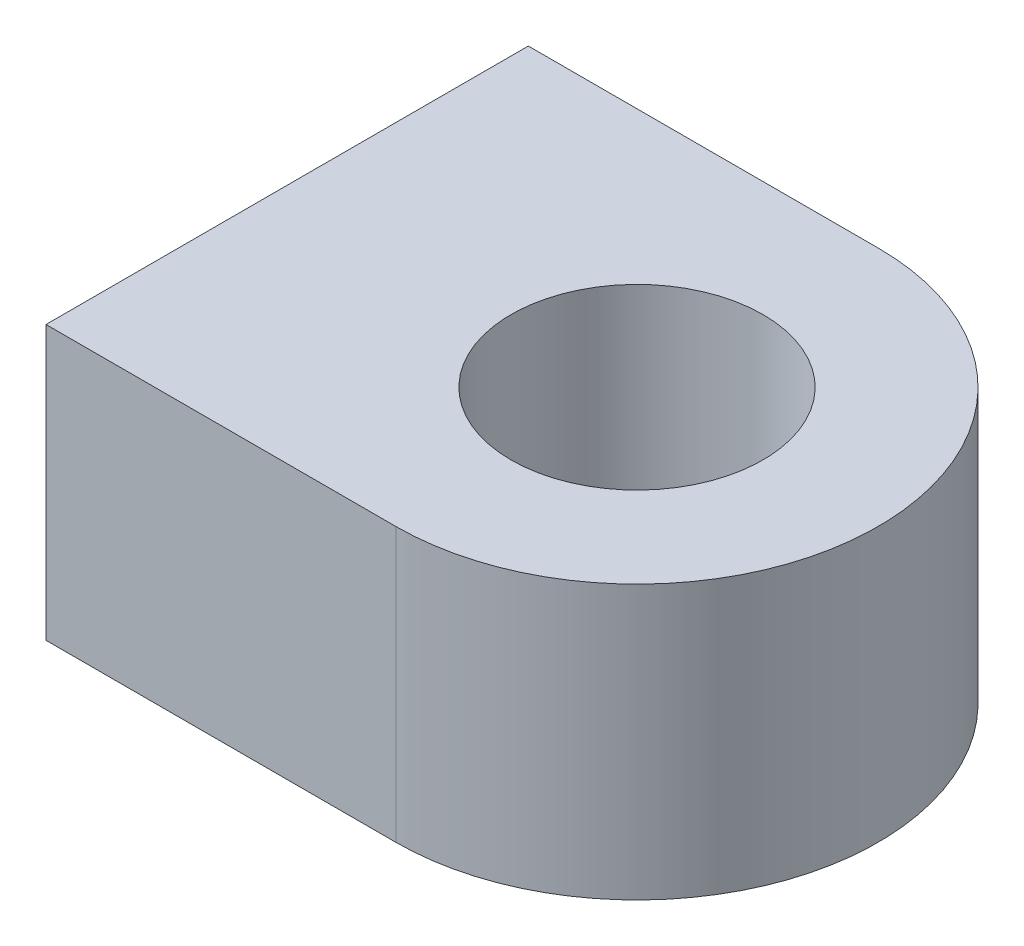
ISO-10303-21;
HEADER;
FILE_DESCRIPTION(('STEP AP214'),'2;1');
FILE_NAME('part.step','',(''),(''),'','','');
FILE_SCHEMA(('AUTOMOTIVE_DESIGN { 1 0 10303 214 1 1 1 1 }'));
ENDSEC;
DATA;
#1=APPLICATION_CONTEXT('core data for automotive mechanical design processes');
#2=APPLICATION_PROTOCOL_DEFINITION('international standard','automotive_design',2000,#1);
#3=PRODUCT_CONTEXT('',#1,'mechanical');
#4=PRODUCT('Part','Part','',(#3));
#5=PRODUCT_RELATED_PRODUCT_CATEGORY('part','',(#4));
#6=PRODUCT_DEFINITION_FORMATION('','',#4);
#7=PRODUCT_DEFINITION_CONTEXT('part definition',#1,'design');
#8=PRODUCT_DEFINITION('design','',#6,#7);
#9=PRODUCT_DEFINITION_SHAPE('','',#8);
#10=(LENGTH_UNIT() NAMED_UNIT(*) SI_UNIT(.MILLI.,.METRE.));
#11=(NAMED_UNIT(*) PLANE_ANGLE_UNIT() SI_UNIT($,.RADIAN.));
#12=(NAMED_UNIT(*) SI_UNIT($,.STERADIAN.) SOLID_ANGLE_UNIT());
#13=UNCERTAINTY_MEASURE_WITH_UNIT(LENGTH_MEASURE(1.E-05),#10,'distance_accuracy_value','');
#14=(GEOMETRIC_REPRESENTATION_CONTEXT(3) GLOBAL_UNCERTAINTY_ASSIGNED_CONTEXT((#13)) GLOBAL_UNIT_ASSIGNED_CONTEXT((#10,
#11,#12)) REPRESENTATION_CONTEXT('',''));
#15=CARTESIAN_POINT('',(0.,0.,0.));
#16=DIRECTION('',(0.,0.,1.));
#17=DIRECTION('',(1.,0.,0.));
#18=AXIS2_PLACEMENT_3D('',#15,#16,#17);
#19=CARTESIAN_POINT('',(0.,5.08,0.));
#20=DIRECTION('',(0.,-1.,0.));
#21=DIRECTION('',(0.,0.,-1.));
#22=AXIS2_PLACEMENT_3D('',#19,#20,#21);
#23=CYLINDRICAL_SURFACE('',#22,2.2225);
#24=CARTESIAN_POINT('',(0.,0.762,0.));
#25=DIRECTION('',(0.,-1.,0.));
#26=DIRECTION('',(0.,0.,-1.));
#27=AXIS2_PLACEMENT_3D('',#24,#25,#26);
#28=CIRCLE('',#27,2.2225);
#29=CARTESIAN_POINT('',(0.,0.762,-2.2225));
#30=VERTEX_POINT('',#29);
#31=EDGE_CURVE('E11',#30,#30,#28,.T.);
#32=ORIENTED_EDGE('',*,*,#31,.T.);
#33=EDGE_LOOP('',(#32));
#34=FACE_BOUND('',#33,.T.);
#35=CARTESIAN_POINT('',(0.,4.826,0.));
#36=DIRECTION('',(0.,1.,0.));
#37=DIRECTION('',(0.,0.,1.));
#38=AXIS2_PLACEMENT_3D('',#35,#36,#37);
#39=CIRCLE('',#38,2.2225);
#40=CARTESIAN_POINT('',(0.,4.826,2.2225));
#41=VERTEX_POINT('',#40);
#42=EDGE_CURVE('E108',#41,#41,#39,.T.);
#43=ORIENTED_EDGE('',*,*,#42,.T.);
#44=EDGE_LOOP('',(#43));
#45=FACE_BOUND('',#44,.T.);
#46=ADVANCED_FACE('F43',(#34,#45),#23,.F.);
#47=CARTESIAN_POINT('',(0.,0.762,0.));
#48=DIRECTION('',(0.,-1.,0.));
#49=DIRECTION('',(0.,0.,-1.));
#50=AXIS2_PLACEMENT_3D('',#47,#48,#49);
#51=PLANE('',#50);
#52=ORIENTED_EDGE('',*,*,#31,.F.);
#53=EDGE_LOOP('',(#52));
#54=FACE_BOUND('',#53,.T.);
#55=ADVANCED_FACE('F134',(#54),#51,.F.);
#56=CARTESIAN_POINT('',(0.,4.826,0.));
#57=DIRECTION('',(0.,1.,0.));
#58=DIRECTION('',(0.,0.,1.));
#59=AXIS2_PLACEMENT_3D('',#56,#57,#58);
#60=PLANE('',#59);
#61=ORIENTED_EDGE('',*,*,#42,.F.);
#62=EDGE_LOOP('',(#61));
#63=FACE_BOUND('',#62,.T.);
#64=DIRECTION('',(-1.,0.,0.));
#65=VECTOR('',#64,1.);
#66=CARTESIAN_POINT('',(0.,4.826,-4.25450000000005));
#67=LINE('',#66,#65);
#68=CARTESIAN_POINT('',(0.,4.826,-4.25450000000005));
#69=VERTEX_POINT('',#68);
#70=CARTESIAN_POINT('',(-6.17220000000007,4.826,-4.25450000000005));
#71=VERTEX_POINT('',#70);
#72=EDGE_CURVE('E94',#69,#71,#67,.T.);
#73=ORIENTED_EDGE('',*,*,#72,.T.);
#74=DIRECTION('',(0.,0.,1.));
#75=VECTOR('',#74,1.);
#76=CARTESIAN_POINT('',(-6.17220000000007,4.826,-4.25450000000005));
#77=LINE('',#76,#75);
#78=CARTESIAN_POINT('',(-6.17220000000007,4.826,4.25450000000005));
#79=VERTEX_POINT('',#78);
#80=EDGE_CURVE('E116',#71,#79,#77,.T.);
#81=ORIENTED_EDGE('',*,*,#80,.T.);
#82=DIRECTION('',(1.,0.,0.));
#83=VECTOR('',#82,1.);
#84=CARTESIAN_POINT('',(-6.17220000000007,4.826,4.25450000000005));
#85=LINE('',#84,#83);
#86=CARTESIAN_POINT('',(0.,4.826,4.25450000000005));
#87=VERTEX_POINT('',#86);
#88=EDGE_CURVE('E57',#79,#87,#85,.T.);
#89=ORIENTED_EDGE('',*,*,#88,.T.);
#90=CARTESIAN_POINT('',(0.,4.826,0.));
#91=DIRECTION('',(0.,1.,0.));
#92=DIRECTION('',(0.,0.,1.));
#93=AXIS2_PLACEMENT_3D('',#90,#91,#92);
#94=CIRCLE('',#93,4.25450000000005);
#95=EDGE_CURVE('E111',#87,#69,#94,.T.);
#96=ORIENTED_EDGE('',*,*,#95,.T.);
#97=EDGE_LOOP('',(#73,#81,#89,#96));
#98=FACE_BOUND('',#97,.T.);
#99=ADVANCED_FACE('F120',(#63,#98),#60,.T.);
#100=CARTESIAN_POINT('',(0.,0.,0.));
#101=DIRECTION('',(0.,1.,0.));
#102=DIRECTION('',(0.,0.,1.));
#103=AXIS2_PLACEMENT_3D('',#100,#101,#102);
#104=PLANE('',#103);
#105=DIRECTION('',(1.,0.,0.));
#106=VECTOR('',#105,1.);
#107=CARTESIAN_POINT('',(0.,0.,4.25450000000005));
#108=LINE('',#107,#106);
#109=CARTESIAN_POINT('',(-6.17220000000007,0.,4.25450000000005));
#110=VERTEX_POINT('',#109);
#111=CARTESIAN_POINT('',(0.,0.,4.25450000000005));
#112=VERTEX_POINT('',#111);
#113=EDGE_CURVE('E106',#110,#112,#108,.T.);
#114=ORIENTED_EDGE('',*,*,#113,.F.);
#115=DIRECTION('',(0.,0.,1.));
#116=VECTOR('',#115,1.);
#117=CARTESIAN_POINT('',(-6.17220000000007,0.,0.));
#118=LINE('',#117,#116);
#119=CARTESIAN_POINT('',(-6.17220000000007,0.,-4.25450000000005));
#120=VERTEX_POINT('',#119);
#121=EDGE_CURVE('E50',#120,#110,#118,.T.);
#122=ORIENTED_EDGE('',*,*,#121,.F.);
#123=DIRECTION('',(-1.,0.,0.));
#124=VECTOR('',#123,1.);
#125=CARTESIAN_POINT('',(0.,0.,-4.25450000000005));
#126=LINE('',#125,#124);
#127=CARTESIAN_POINT('',(0.,0.,-4.25450000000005));
#128=VERTEX_POINT('',#127);
#129=EDGE_CURVE('E78',#128,#120,#126,.T.);
#130=ORIENTED_EDGE('',*,*,#129,.F.);
#131=CARTESIAN_POINT('',(0.,0.,0.));
#132=DIRECTION('',(0.,1.,0.));
#133=DIRECTION('',(-1.,0.,0.));
#134=AXIS2_PLACEMENT_3D('',#131,#132,#133);
#135=CIRCLE('',#134,4.25450000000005);
#136=EDGE_CURVE('E82',#128,#112,#135,.F.);
#137=ORIENTED_EDGE('',*,*,#136,.T.);
#138=EDGE_LOOP('',(#114,#122,#130,#137));
#139=FACE_BOUND('',#138,.T.);
#140=ADVANCED_FACE('F80',(#139),#104,.F.);
#141=CARTESIAN_POINT('',(0.,-13.4580516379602,0.));
#142=DIRECTION('',(0.,1.,0.));
#143=DIRECTION('',(0.,0.,1.));
#144=AXIS2_PLACEMENT_3D('',#141,#142,#143);
#145=CYLINDRICAL_SURFACE('',#144,4.25450000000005);
#146=DIRECTION('',(0.,1.,0.));
#147=VECTOR('',#146,1.);
#148=CARTESIAN_POINT('',(0.,-13.4580516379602,-4.25450000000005));
#149=LINE('',#148,#147);
#150=EDGE_CURVE('E91',#128,#69,#149,.T.);
#151=ORIENTED_EDGE('',*,*,#150,.T.);
#152=ORIENTED_EDGE('',*,*,#95,.F.);
#153=DIRECTION('',(0.,1.,0.));
#154=VECTOR('',#153,1.);
#155=CARTESIAN_POINT('',(0.,-13.4580516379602,4.25450000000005));
#156=LINE('',#155,#154);
#157=EDGE_CURVE('E100',#112,#87,#156,.T.);
#158=ORIENTED_EDGE('',*,*,#157,.F.);
#159=ORIENTED_EDGE('',*,*,#136,.F.);
#160=EDGE_LOOP('',(#151,#152,#158,#159));
#161=FACE_BOUND('',#160,.T.);
#162=ADVANCED_FACE('F98',(#161),#145,.T.);
#163=CARTESIAN_POINT('',(0.,-13.4580516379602,-4.25450000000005));
#164=DIRECTION('',(0.,0.,1.));
#165=DIRECTION('',(1.,0.,0.));
#166=AXIS2_PLACEMENT_3D('',#163,#164,#165);
#167=PLANE('',#166);
#168=ORIENTED_EDGE('',*,*,#72,.F.);
#169=ORIENTED_EDGE('',*,*,#150,.F.);
#170=ORIENTED_EDGE('',*,*,#129,.T.);
#171=DIRECTION('',(0.,1.,0.));
#172=VECTOR('',#171,1.);
#173=CARTESIAN_POINT('',(-6.17220000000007,-13.4580516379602,-4.25450000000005));
#174=LINE('',#173,#172);
#175=EDGE_CURVE('E86',#120,#71,#174,.T.);
#176=ORIENTED_EDGE('',*,*,#175,.T.);
#177=EDGE_LOOP('',(#168,#169,#170,#176));
#178=FACE_BOUND('',#177,.T.);
#179=ADVANCED_FACE('F92',(#178),#167,.F.);
#180=CARTESIAN_POINT('',(0.,-13.4580516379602,4.25450000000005));
#181=DIRECTION('',(0.,0.,-1.));
#182=DIRECTION('',(-1.,0.,0.));
#183=AXIS2_PLACEMENT_3D('',#180,#181,#182);
#184=PLANE('',#183);
#185=ORIENTED_EDGE('',*,*,#88,.F.);
#186=DIRECTION('',(0.,1.,0.));
#187=VECTOR('',#186,1.);
#188=CARTESIAN_POINT('',(-6.17220000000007,-13.4580516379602,4.25450000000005));
#189=LINE('',#188,#187);
#190=EDGE_CURVE('E87',#110,#79,#189,.T.);
#191=ORIENTED_EDGE('',*,*,#190,.F.);
#192=ORIENTED_EDGE('',*,*,#113,.T.);
#193=ORIENTED_EDGE('',*,*,#157,.T.);
#194=EDGE_LOOP('',(#185,#191,#192,#193));
#195=FACE_BOUND('',#194,.T.);
#196=ADVANCED_FACE('F124',(#195),#184,.F.);
#197=CARTESIAN_POINT('',(-6.17220000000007,-10.3073312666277,0.));
#198=DIRECTION('',(1.,0.,0.));
#199=DIRECTION('',(0.,0.,-1.));
#200=AXIS2_PLACEMENT_3D('',#197,#198,#199);
#201=PLANE('',#200);
#202=ORIENTED_EDGE('',*,*,#80,.F.);
#203=ORIENTED_EDGE('',*,*,#175,.F.);
#204=ORIENTED_EDGE('',*,*,#121,.T.);
#205=ORIENTED_EDGE('',*,*,#190,.T.);
#206=EDGE_LOOP('',(#202,#203,#204,#205));
#207=FACE_BOUND('',#206,.T.);
#208=ADVANCED_FACE('F123',(#207),#201,.F.);
#209=CLOSED_SHELL('',(#46,#55,#99,#140,#162,#179,#196,#208));
#210=MANIFOLD_SOLID_BREP('B2',#209);
#211=ADVANCED_BREP_SHAPE_REPRESENTATION('',(#18,#210),#14);
#212=SHAPE_DEFINITION_REPRESENTATION(#9,#211);
ENDSEC;
END-ISO-10303-21;
